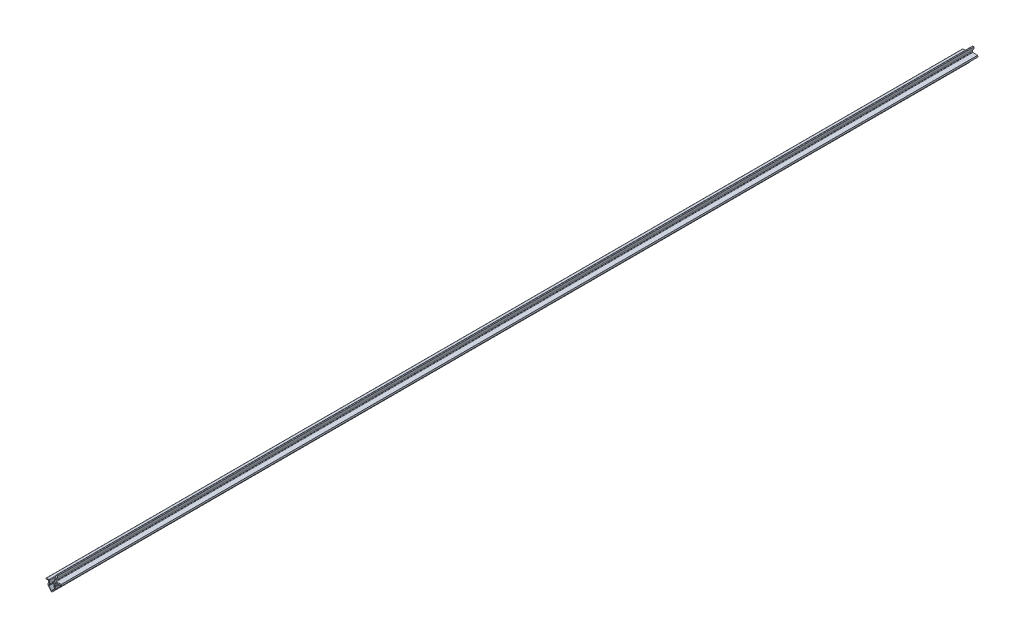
from build123d import *

# Parameters (mm, degrees)
EXTRUDE_1_DEPTH = 1000


with BuildPart() as part:
    # Sketch 2 → Extrude 1 (new body)
    with BuildSketch(Plane.XY):
        with BuildLine():
            Line((-2.147942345, 3.6), (-1.623243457, 3.6))
            Line((-1.623243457, 3.6), (-1.423279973, 6))
            Line((-1.423279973, 6), (-2.486317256, 6))
            ThreePointArc((-2.486317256, 6), (-3.123185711, 5.770972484), (-3.468333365, 5.188797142))
            Line((-3.468333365, 5.188797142), (-4.676665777, -1.096265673))
            ThreePointArc((-4.676665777, -1.096265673), (-4.771089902, -1.30636864), (-4.949683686, -1.451845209))
            ThreePointArc((-4.949683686, -1.451845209), (-5.155365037, -1.636300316), (-5.231693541, -1.901823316))
            Line((-5.231693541, -1.901823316), (-5.231693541, -6.016497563))
            ThreePointArc((-5.231693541, -6.016497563), (-5.150023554, -6.290358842), (-4.931693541, -6.474755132))
            ThreePointArc((-4.931693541, -6.474755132), (-4.713363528, -6.659151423), (-4.631693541, -6.933012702))
            Line((-4.631693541, -6.933012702), (-4.631693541, -7.644906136))
            ThreePointArc((-4.631693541, -7.644906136), (-4.660887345, -7.813255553), (-4.745059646, -7.96194593))
            Line((-4.745059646, -7.96194593), (-7.295059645, -11.071702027))
            ThreePointArc((-7.295059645, -11.071702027), (-7.68169354, -11.254662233), (-8.068327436, -11.071702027))
            Line((-8.068327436, -11.071702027), (-10.618327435, -7.96194593))
            ThreePointArc((-10.618327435, -7.96194593), (-10.702499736, -7.813255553), (-10.73169354, -7.644906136))
            Line((-10.73169354, -7.644906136), (-10.73169354, -6.933012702))
            ThreePointArc((-10.73169354, -6.933012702), (-10.650023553, -6.659151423), (-10.43169354, -6.474755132))
            ThreePointArc((-10.43169354, -6.474755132), (-10.213363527, -6.290358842), (-10.13169354, -6.016497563))
            Line((-10.13169354, -6.016497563), (-10.13169354, -2.5))
            ThreePointArc((-10.13169354, -2.5), (-10.278140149, -2.146446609), (-10.63169354, -2))
            Line((-10.63169354, -2), (-13.38169354, -2))
            ThreePointArc((-13.38169354, -2), (-13.735246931, -2.146446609), (-13.88169354, -2.5))
            Line((-13.88169354, -2.5), (-13.88169354, -3))
            Line((-13.88169354, -3), (-11.43169354, -3))
            ThreePointArc((-11.43169354, -3), (-11.078140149, -3.146446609), (-10.93169354, -3.5))
            Line((-10.93169354, -3.5), (-10.93169354, -4.949510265))
            ThreePointArc((-10.93169354, -4.949510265), (-11.013363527, -5.223371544), (-11.23169354, -5.407767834))
            ThreePointArc((-11.23169354, -5.407767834), (-11.450023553, -5.592164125), (-11.53169354, -5.866025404))
            Line((-11.53169354, -5.866025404), (-11.53169354, -7.930967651))
            ThreePointArc((-11.53169354, -7.930967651), (-11.502499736, -8.099317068), (-11.418327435, -8.248007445))
            Line((-11.418327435, -8.248007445), (-8.686941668, -11.578965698))
            ThreePointArc((-8.686941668, -11.578965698), (-7.68169354, -12.054662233), (-6.676445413, -11.578965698))
            Line((-6.676445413, -11.578965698), (-3.945059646, -8.248007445))
            ThreePointArc((-3.945059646, -8.248007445), (-3.860887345, -8.099317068), (-3.831693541, -7.930967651))
            Line((-3.831693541, -7.930967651), (-3.831693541, -5.866025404))
            ThreePointArc((-3.831693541, -5.866025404), (-3.913363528, -5.592164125), (-4.131693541, -5.407767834))
            ThreePointArc((-4.131693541, -5.407767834), (-4.350023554, -5.223371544), (-4.431693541, -4.949510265))
            Line((-4.431693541, -4.949510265), (-4.431693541, -3.5))
            ThreePointArc((-4.431693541, -3.5), (-4.285246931, -3.146446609), (-3.931693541, -3))
            Line((-3.931693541, -3), (-3.403183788, -3))
            Line((-3.403183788, -3), (-3.403183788, -1.65))
            ThreePointArc((-3.403183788, -1.65), (-3.27138184, -1.331801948), (-2.953183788, -1.2))
            Line((-2.953183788, -1.2), (-1.68169354, -1.2))
            Line((-1.68169354, -1.2), (-1.48169354, -2))
            Line((-1.48169354, -2), (-0.68169354, -1.2))
            Line((-0.68169354, -1.2), (-0.48169354, -2))
            Line((-0.48169354, -2), (0.31830646, -1.2))
            Line((0.31830646, -1.2), (0.51830646, -2))
            Line((0.51830646, -2), (1.31830646, -1.2))
            Line((1.31830646, -1.2), (1.51830646, -2))
            Line((1.51830646, -2), (2.31830646, -1.2))
            Line((2.31830646, -1.2), (2.51830646, -2))
            Line((2.51830646, -2), (3.01830646, -1.5))
            Line((3.01830646, -1.5), (2.64330646, 0))
            Line((2.64330646, 0), (-2.64330646, 0))
            ThreePointArc((-2.64330646, 0), (-3.028553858, 0.181276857), (-3.134455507, 0.593662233))
            Line((-3.134455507, 0.593662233), (-2.634685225, 3.214373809))
            ThreePointArc((-2.634685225, 3.214373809), (-2.458436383, 3.491910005), (-2.147942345, 3.6))
        make_face()
    extrude(amount=EXTRUDE_1_DEPTH)


solid = part.part
